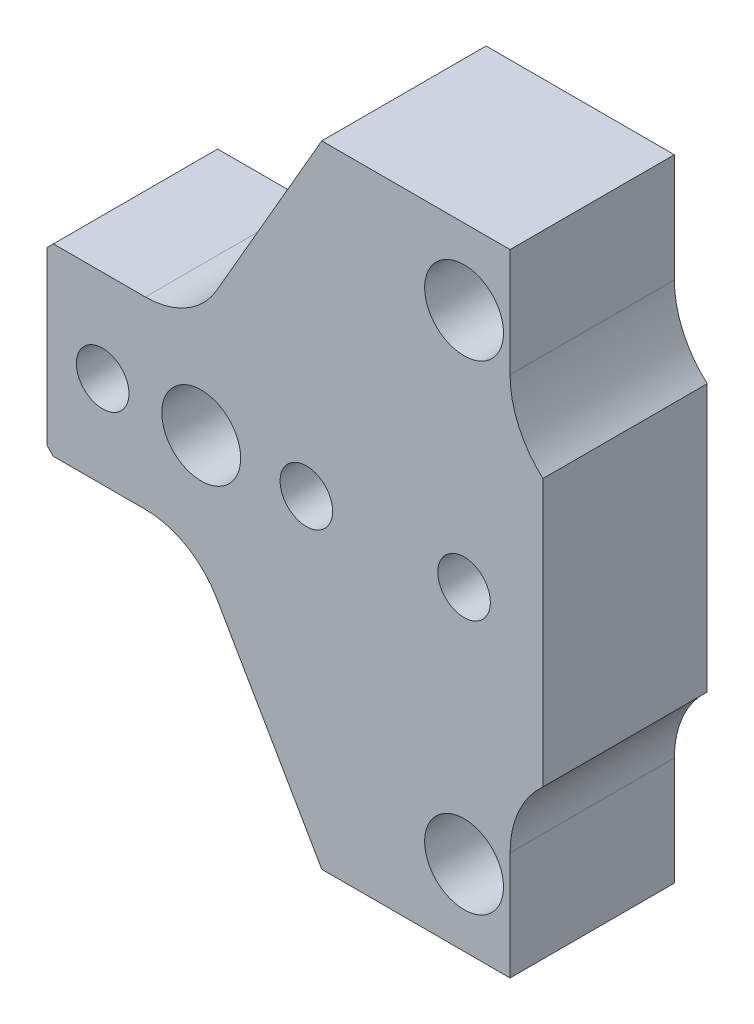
ISO-10303-21;
HEADER;
FILE_DESCRIPTION(('STEP AP214'),'2;1');
FILE_NAME('part.step','',(''),(''),'','','');
FILE_SCHEMA(('AUTOMOTIVE_DESIGN { 1 0 10303 214 1 1 1 1 }'));
ENDSEC;
DATA;
#1=APPLICATION_CONTEXT('core data for automotive mechanical design processes');
#2=APPLICATION_PROTOCOL_DEFINITION('international standard','automotive_design',2000,#1);
#3=PRODUCT_CONTEXT('',#1,'mechanical');
#4=PRODUCT('Part','Part','',(#3));
#5=PRODUCT_RELATED_PRODUCT_CATEGORY('part','',(#4));
#6=PRODUCT_DEFINITION_FORMATION('','',#4);
#7=PRODUCT_DEFINITION_CONTEXT('part definition',#1,'design');
#8=PRODUCT_DEFINITION('design','',#6,#7);
#9=PRODUCT_DEFINITION_SHAPE('','',#8);
#10=(LENGTH_UNIT() NAMED_UNIT(*) SI_UNIT(.MILLI.,.METRE.));
#11=(NAMED_UNIT(*) PLANE_ANGLE_UNIT() SI_UNIT($,.RADIAN.));
#12=(NAMED_UNIT(*) SI_UNIT($,.STERADIAN.) SOLID_ANGLE_UNIT());
#13=UNCERTAINTY_MEASURE_WITH_UNIT(LENGTH_MEASURE(1.E-05),#10,'distance_accuracy_value','');
#14=(GEOMETRIC_REPRESENTATION_CONTEXT(3) GLOBAL_UNCERTAINTY_ASSIGNED_CONTEXT((#13)) GLOBAL_UNIT_ASSIGNED_CONTEXT((#10,
#11,#12)) REPRESENTATION_CONTEXT('',''));
#15=CARTESIAN_POINT('',(0.,0.,0.));
#16=DIRECTION('',(0.,0.,1.));
#17=DIRECTION('',(1.,0.,0.));
#18=AXIS2_PLACEMENT_3D('',#15,#16,#17);
#19=CARTESIAN_POINT('',(-8.5,-26.5,25.));
#20=DIRECTION('',(0.,0.,1.));
#21=DIRECTION('',(1.,0.,0.));
#22=AXIS2_PLACEMENT_3D('',#19,#20,#21);
#23=PLANE('',#22);
#24=CARTESIAN_POINT('',(40.,36.5,25.));
#25=DIRECTION('',(0.,0.,1.));
#26=DIRECTION('',(1.,0.,0.));
#27=AXIS2_PLACEMENT_3D('',#24,#25,#26);
#28=CIRCLE('',#27,6.00000000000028);
#29=CARTESIAN_POINT('',(46.0000000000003,36.5,25.));
#30=VERTEX_POINT('',#29);
#31=EDGE_CURVE('E334',#30,#30,#28,.T.);
#32=ORIENTED_EDGE('',*,*,#31,.F.);
#33=EDGE_LOOP('',(#32));
#34=FACE_BOUND('',#33,.T.);
#35=CARTESIAN_POINT('',(-15.,0.,25.));
#36=DIRECTION('',(0.,0.,1.));
#37=DIRECTION('',(1.,0.,0.));
#38=AXIS2_PLACEMENT_3D('',#35,#36,#37);
#39=CIRCLE('',#38,4.);
#40=CARTESIAN_POINT('',(-11.,0.,25.));
#41=VERTEX_POINT('',#40);
#42=EDGE_CURVE('E346',#41,#41,#39,.T.);
#43=ORIENTED_EDGE('',*,*,#42,.F.);
#44=EDGE_LOOP('',(#43));
#45=FACE_BOUND('',#44,.T.);
#46=CARTESIAN_POINT('',(16.,0.,25.));
#47=DIRECTION('',(0.,0.,1.));
#48=DIRECTION('',(1.,0.,0.));
#49=AXIS2_PLACEMENT_3D('',#46,#47,#48);
#50=CIRCLE('',#49,4.);
#51=CARTESIAN_POINT('',(20.,0.,25.));
#52=VERTEX_POINT('',#51);
#53=EDGE_CURVE('E163',#52,#52,#50,.T.);
#54=ORIENTED_EDGE('',*,*,#53,.F.);
#55=EDGE_LOOP('',(#54));
#56=FACE_BOUND('',#55,.T.);
#57=DIRECTION('',(0.707106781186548,-0.707106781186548,0.));
#58=VECTOR('',#57,1.);
#59=CARTESIAN_POINT('',(-23.5,-13.,25.));
#60=LINE('',#59,#58);
#61=CARTESIAN_POINT('',(-23.5,-13.,25.));
#62=VERTEX_POINT('',#61);
#63=CARTESIAN_POINT('',(-22.5,-14.,25.));
#64=VERTEX_POINT('',#63);
#65=EDGE_CURVE('E190',#62,#64,#60,.T.);
#66=ORIENTED_EDGE('',*,*,#65,.T.);
#67=DIRECTION('',(1.,0.,0.));
#68=VECTOR('',#67,1.);
#69=CARTESIAN_POINT('',(-8.5,-14.,25.));
#70=LINE('',#69,#68);
#71=CARTESIAN_POINT('',(-8.5,-14.,25.));
#72=VERTEX_POINT('',#71);
#73=EDGE_CURVE('E98',#64,#72,#70,.T.);
#74=ORIENTED_EDGE('',*,*,#73,.T.);
#75=CARTESIAN_POINT('',(-8.5,-26.5,25.));
#76=DIRECTION('',(0.,0.,-1.));
#77=DIRECTION('',(1.,0.,0.));
#78=AXIS2_PLACEMENT_3D('',#75,#76,#77);
#79=CIRCLE('',#78,12.5);
#80=CARTESIAN_POINT('',(2.32531754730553,-20.25,25.));
#81=VERTEX_POINT('',#80);
#82=EDGE_CURVE('E229',#72,#81,#79,.T.);
#83=ORIENTED_EDGE('',*,*,#82,.T.);
#84=DIRECTION('',(0.5,-0.866025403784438,0.));
#85=VECTOR('',#84,1.);
#86=CARTESIAN_POINT('',(18.3467875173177,-48.,25.));
#87=LINE('',#86,#85);
#88=CARTESIAN_POINT('',(18.3467875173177,-48.,25.));
#89=VERTEX_POINT('',#88);
#90=EDGE_CURVE('E248',#81,#89,#87,.T.);
#91=ORIENTED_EDGE('',*,*,#90,.T.);
#92=DIRECTION('',(1.,0.,0.));
#93=VECTOR('',#92,1.);
#94=CARTESIAN_POINT('',(47.,-48.,25.));
#95=LINE('',#94,#93);
#96=CARTESIAN_POINT('',(47.,-48.,25.));
#97=VERTEX_POINT('',#96);
#98=EDGE_CURVE('E245',#89,#97,#95,.T.);
#99=ORIENTED_EDGE('',*,*,#98,.T.);
#100=DIRECTION('',(0.,1.,0.));
#101=VECTOR('',#100,1.);
#102=CARTESIAN_POINT('',(47.,-31.5,25.));
#103=LINE('',#102,#101);
#104=CARTESIAN_POINT('',(47.,-31.5,25.));
#105=VERTEX_POINT('',#104);
#106=EDGE_CURVE('E247',#97,#105,#103,.T.);
#107=ORIENTED_EDGE('',*,*,#106,.T.);
#108=CARTESIAN_POINT('',(62.,-31.5,25.));
#109=DIRECTION('',(0.,0.,-1.));
#110=DIRECTION('',(1.,0.,0.));
#111=AXIS2_PLACEMENT_3D('',#108,#109,#110);
#112=CIRCLE('',#111,15.);
#113=CARTESIAN_POINT('',(52.,-20.3196601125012,25.));
#114=VERTEX_POINT('',#113);
#115=EDGE_CURVE('E250',#105,#114,#112,.T.);
#116=ORIENTED_EDGE('',*,*,#115,.T.);
#117=DIRECTION('',(0.,1.,0.));
#118=VECTOR('',#117,1.);
#119=CARTESIAN_POINT('',(52.,20.3196601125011,25.));
#120=LINE('',#119,#118);
#121=CARTESIAN_POINT('',(52.,20.3196601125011,25.));
#122=VERTEX_POINT('',#121);
#123=EDGE_CURVE('E256',#114,#122,#120,.T.);
#124=ORIENTED_EDGE('',*,*,#123,.T.);
#125=CARTESIAN_POINT('',(62.,31.5,25.));
#126=DIRECTION('',(0.,0.,-1.));
#127=DIRECTION('',(1.,0.,0.));
#128=AXIS2_PLACEMENT_3D('',#125,#126,#127);
#129=CIRCLE('',#128,15.);
#130=CARTESIAN_POINT('',(47.,31.5,25.));
#131=VERTEX_POINT('',#130);
#132=EDGE_CURVE('E258',#122,#131,#129,.T.);
#133=ORIENTED_EDGE('',*,*,#132,.T.);
#134=DIRECTION('',(0.,1.,0.));
#135=VECTOR('',#134,1.);
#136=CARTESIAN_POINT('',(47.,48.,25.));
#137=LINE('',#136,#135);
#138=CARTESIAN_POINT('',(47.,48.,25.));
#139=VERTEX_POINT('',#138);
#140=EDGE_CURVE('E260',#131,#139,#137,.T.);
#141=ORIENTED_EDGE('',*,*,#140,.T.);
#142=DIRECTION('',(-1.,0.,0.));
#143=VECTOR('',#142,1.);
#144=CARTESIAN_POINT('',(18.3467875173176,48.,25.));
#145=LINE('',#144,#143);
#146=CARTESIAN_POINT('',(18.3467875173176,48.,25.));
#147=VERTEX_POINT('',#146);
#148=EDGE_CURVE('E262',#139,#147,#145,.T.);
#149=ORIENTED_EDGE('',*,*,#148,.T.);
#150=DIRECTION('',(-0.5,-0.866025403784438,0.));
#151=VECTOR('',#150,1.);
#152=CARTESIAN_POINT('',(2.32531754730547,20.25,25.));
#153=LINE('',#152,#151);
#154=CARTESIAN_POINT('',(2.32531754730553,20.25,25.));
#155=VERTEX_POINT('',#154);
#156=EDGE_CURVE('E264',#147,#155,#153,.T.);
#157=ORIENTED_EDGE('',*,*,#156,.T.);
#158=CARTESIAN_POINT('',(-8.5,26.5,25.));
#159=DIRECTION('',(0.,0.,-1.));
#160=DIRECTION('',(1.,0.,0.));
#161=AXIS2_PLACEMENT_3D('',#158,#159,#160);
#162=CIRCLE('',#161,12.5);
#163=CARTESIAN_POINT('',(-8.5,14.,25.));
#164=VERTEX_POINT('',#163);
#165=EDGE_CURVE('E141',#155,#164,#162,.T.);
#166=ORIENTED_EDGE('',*,*,#165,.T.);
#167=DIRECTION('',(-1.,0.,0.));
#168=VECTOR('',#167,1.);
#169=CARTESIAN_POINT('',(-22.5,14.,25.));
#170=LINE('',#169,#168);
#171=CARTESIAN_POINT('',(-22.5,14.,25.));
#172=VERTEX_POINT('',#171);
#173=EDGE_CURVE('E135',#164,#172,#170,.T.);
#174=ORIENTED_EDGE('',*,*,#173,.T.);
#175=DIRECTION('',(-0.707106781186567,-0.707106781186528,0.));
#176=VECTOR('',#175,1.);
#177=CARTESIAN_POINT('',(-22.5,14.,25.));
#178=LINE('',#177,#176);
#179=CARTESIAN_POINT('',(-23.5,13.,25.));
#180=VERTEX_POINT('',#179);
#181=EDGE_CURVE('E139',#172,#180,#178,.T.);
#182=ORIENTED_EDGE('',*,*,#181,.T.);
#183=DIRECTION('',(0.,-1.,0.));
#184=VECTOR('',#183,1.);
#185=CARTESIAN_POINT('',(-23.5,-13.,25.));
#186=LINE('',#185,#184);
#187=EDGE_CURVE('E31',#180,#62,#186,.T.);
#188=ORIENTED_EDGE('',*,*,#187,.T.);
#189=EDGE_LOOP('',(#66,#74,#83,#91,#99,#107,#116,#124,#133,#141,#149,#157,#166,#174,#182,#188));
#190=FACE_BOUND('',#189,.T.);
#191=CARTESIAN_POINT('',(40.,0.,25.));
#192=DIRECTION('',(0.,0.,1.));
#193=DIRECTION('',(1.,0.,0.));
#194=AXIS2_PLACEMENT_3D('',#191,#192,#193);
#195=CIRCLE('',#194,4.);
#196=CARTESIAN_POINT('',(44.,0.,25.));
#197=VERTEX_POINT('',#196);
#198=EDGE_CURVE('E352',#197,#197,#195,.T.);
#199=ORIENTED_EDGE('',*,*,#198,.F.);
#200=EDGE_LOOP('',(#199));
#201=FACE_BOUND('',#200,.T.);
#202=CARTESIAN_POINT('',(0.,0.,25.));
#203=DIRECTION('',(0.,0.,1.));
#204=DIRECTION('',(1.,0.,0.));
#205=AXIS2_PLACEMENT_3D('',#202,#203,#204);
#206=CIRCLE('',#205,6.00000000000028);
#207=CARTESIAN_POINT('',(6.00000000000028,0.,25.));
#208=VERTEX_POINT('',#207);
#209=EDGE_CURVE('E340',#208,#208,#206,.T.);
#210=ORIENTED_EDGE('',*,*,#209,.F.);
#211=EDGE_LOOP('',(#210));
#212=FACE_BOUND('',#211,.T.);
#213=CARTESIAN_POINT('',(40.,-36.5,25.));
#214=DIRECTION('',(0.,0.,1.));
#215=DIRECTION('',(1.,0.,0.));
#216=AXIS2_PLACEMENT_3D('',#213,#214,#215);
#217=CIRCLE('',#216,6.00000000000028);
#218=CARTESIAN_POINT('',(46.0000000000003,-36.5,25.));
#219=VERTEX_POINT('',#218);
#220=EDGE_CURVE('E325',#219,#219,#217,.T.);
#221=ORIENTED_EDGE('',*,*,#220,.F.);
#222=EDGE_LOOP('',(#221));
#223=FACE_BOUND('',#222,.T.);
#224=ADVANCED_FACE('F14',(#34,#45,#56,#190,#201,#212,#223),#23,.T.);
#225=CARTESIAN_POINT('',(-8.5,-26.5,0.));
#226=DIRECTION('',(0.,0.,1.));
#227=DIRECTION('',(1.,0.,0.));
#228=AXIS2_PLACEMENT_3D('',#225,#226,#227);
#229=PLANE('',#228);
#230=CARTESIAN_POINT('',(40.,36.5,0.));
#231=DIRECTION('',(0.,0.,1.));
#232=DIRECTION('',(1.,0.,0.));
#233=AXIS2_PLACEMENT_3D('',#230,#231,#232);
#234=CIRCLE('',#233,6.00000000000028);
#235=CARTESIAN_POINT('',(46.0000000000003,36.5,0.));
#236=VERTEX_POINT('',#235);
#237=EDGE_CURVE('E331',#236,#236,#234,.T.);
#238=ORIENTED_EDGE('',*,*,#237,.T.);
#239=EDGE_LOOP('',(#238));
#240=FACE_BOUND('',#239,.T.);
#241=CARTESIAN_POINT('',(-15.,0.,0.));
#242=DIRECTION('',(0.,0.,1.));
#243=DIRECTION('',(1.,0.,0.));
#244=AXIS2_PLACEMENT_3D('',#241,#242,#243);
#245=CIRCLE('',#244,4.);
#246=CARTESIAN_POINT('',(-11.,0.,0.));
#247=VERTEX_POINT('',#246);
#248=EDGE_CURVE('E343',#247,#247,#245,.T.);
#249=ORIENTED_EDGE('',*,*,#248,.T.);
#250=EDGE_LOOP('',(#249));
#251=FACE_BOUND('',#250,.T.);
#252=CARTESIAN_POINT('',(16.,0.,0.));
#253=DIRECTION('',(0.,0.,1.));
#254=DIRECTION('',(1.,0.,0.));
#255=AXIS2_PLACEMENT_3D('',#252,#253,#254);
#256=CIRCLE('',#255,4.);
#257=CARTESIAN_POINT('',(20.,0.,0.));
#258=VERTEX_POINT('',#257);
#259=EDGE_CURVE('E355',#258,#258,#256,.T.);
#260=ORIENTED_EDGE('',*,*,#259,.T.);
#261=EDGE_LOOP('',(#260));
#262=FACE_BOUND('',#261,.T.);
#263=DIRECTION('',(0.707106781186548,-0.707106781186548,0.));
#264=VECTOR('',#263,1.);
#265=CARTESIAN_POINT('',(-23.5,-13.,0.));
#266=LINE('',#265,#264);
#267=CARTESIAN_POINT('',(-23.5,-13.,0.));
#268=VERTEX_POINT('',#267);
#269=CARTESIAN_POINT('',(-22.5,-14.,0.));
#270=VERTEX_POINT('',#269);
#271=EDGE_CURVE('E159',#268,#270,#266,.T.);
#272=ORIENTED_EDGE('',*,*,#271,.F.);
#273=DIRECTION('',(0.,-1.,0.));
#274=VECTOR('',#273,1.);
#275=CARTESIAN_POINT('',(-23.5,-13.,0.));
#276=LINE('',#275,#274);
#277=CARTESIAN_POINT('',(-23.5,13.,0.));
#278=VERTEX_POINT('',#277);
#279=EDGE_CURVE('E90',#278,#268,#276,.T.);
#280=ORIENTED_EDGE('',*,*,#279,.F.);
#281=DIRECTION('',(-0.707106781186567,-0.707106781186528,0.));
#282=VECTOR('',#281,1.);
#283=CARTESIAN_POINT('',(-22.5,14.,0.));
#284=LINE('',#283,#282);
#285=CARTESIAN_POINT('',(-22.5,14.,0.));
#286=VERTEX_POINT('',#285);
#287=EDGE_CURVE('E84',#286,#278,#284,.T.);
#288=ORIENTED_EDGE('',*,*,#287,.F.);
#289=DIRECTION('',(-1.,0.,0.));
#290=VECTOR('',#289,1.);
#291=CARTESIAN_POINT('',(-22.5,14.,0.));
#292=LINE('',#291,#290);
#293=CARTESIAN_POINT('',(-8.5,14.,0.));
#294=VERTEX_POINT('',#293);
#295=EDGE_CURVE('E149',#294,#286,#292,.T.);
#296=ORIENTED_EDGE('',*,*,#295,.F.);
#297=CARTESIAN_POINT('',(-8.5,26.5,0.));
#298=DIRECTION('',(0.,0.,-1.));
#299=DIRECTION('',(1.,0.,0.));
#300=AXIS2_PLACEMENT_3D('',#297,#298,#299);
#301=CIRCLE('',#300,12.5);
#302=CARTESIAN_POINT('',(2.32531754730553,20.25,0.));
#303=VERTEX_POINT('',#302);
#304=EDGE_CURVE('E185',#303,#294,#301,.T.);
#305=ORIENTED_EDGE('',*,*,#304,.F.);
#306=DIRECTION('',(-0.5,-0.866025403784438,0.));
#307=VECTOR('',#306,1.);
#308=CARTESIAN_POINT('',(2.32531754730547,20.25,0.));
#309=LINE('',#308,#307);
#310=CARTESIAN_POINT('',(18.3467875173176,48.,0.));
#311=VERTEX_POINT('',#310);
#312=EDGE_CURVE('E183',#311,#303,#309,.T.);
#313=ORIENTED_EDGE('',*,*,#312,.F.);
#314=DIRECTION('',(-1.,0.,0.));
#315=VECTOR('',#314,1.);
#316=CARTESIAN_POINT('',(18.3467875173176,48.,0.));
#317=LINE('',#316,#315);
#318=CARTESIAN_POINT('',(47.,48.,0.));
#319=VERTEX_POINT('',#318);
#320=EDGE_CURVE('E181',#319,#311,#317,.T.);
#321=ORIENTED_EDGE('',*,*,#320,.F.);
#322=DIRECTION('',(0.,1.,0.));
#323=VECTOR('',#322,1.);
#324=CARTESIAN_POINT('',(47.,48.,0.));
#325=LINE('',#324,#323);
#326=CARTESIAN_POINT('',(47.,31.5,0.));
#327=VERTEX_POINT('',#326);
#328=EDGE_CURVE('E179',#327,#319,#325,.T.);
#329=ORIENTED_EDGE('',*,*,#328,.F.);
#330=CARTESIAN_POINT('',(62.,31.5,0.));
#331=DIRECTION('',(0.,0.,-1.));
#332=DIRECTION('',(1.,0.,0.));
#333=AXIS2_PLACEMENT_3D('',#330,#331,#332);
#334=CIRCLE('',#333,15.);
#335=CARTESIAN_POINT('',(52.,20.3196601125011,0.));
#336=VERTEX_POINT('',#335);
#337=EDGE_CURVE('E177',#336,#327,#334,.T.);
#338=ORIENTED_EDGE('',*,*,#337,.F.);
#339=DIRECTION('',(0.,1.,0.));
#340=VECTOR('',#339,1.);
#341=CARTESIAN_POINT('',(52.,20.3196601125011,0.));
#342=LINE('',#341,#340);
#343=CARTESIAN_POINT('',(52.,-20.3196601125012,0.));
#344=VERTEX_POINT('',#343);
#345=EDGE_CURVE('E175',#344,#336,#342,.T.);
#346=ORIENTED_EDGE('',*,*,#345,.F.);
#347=CARTESIAN_POINT('',(62.,-31.5,0.));
#348=DIRECTION('',(0.,0.,-1.));
#349=DIRECTION('',(1.,0.,0.));
#350=AXIS2_PLACEMENT_3D('',#347,#348,#349);
#351=CIRCLE('',#350,15.);
#352=CARTESIAN_POINT('',(47.,-31.5,0.));
#353=VERTEX_POINT('',#352);
#354=EDGE_CURVE('E173',#353,#344,#351,.T.);
#355=ORIENTED_EDGE('',*,*,#354,.F.);
#356=DIRECTION('',(0.,1.,0.));
#357=VECTOR('',#356,1.);
#358=CARTESIAN_POINT('',(47.,-31.5,0.));
#359=LINE('',#358,#357);
#360=CARTESIAN_POINT('',(47.,-48.,0.));
#361=VERTEX_POINT('',#360);
#362=EDGE_CURVE('E171',#361,#353,#359,.T.);
#363=ORIENTED_EDGE('',*,*,#362,.F.);
#364=DIRECTION('',(1.,0.,0.));
#365=VECTOR('',#364,1.);
#366=CARTESIAN_POINT('',(47.,-48.,0.));
#367=LINE('',#366,#365);
#368=CARTESIAN_POINT('',(18.3467875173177,-48.,0.));
#369=VERTEX_POINT('',#368);
#370=EDGE_CURVE('E169',#369,#361,#367,.T.);
#371=ORIENTED_EDGE('',*,*,#370,.F.);
#372=DIRECTION('',(0.5,-0.866025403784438,0.));
#373=VECTOR('',#372,1.);
#374=CARTESIAN_POINT('',(18.3467875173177,-48.,0.));
#375=LINE('',#374,#373);
#376=CARTESIAN_POINT('',(2.32531754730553,-20.25,0.));
#377=VERTEX_POINT('',#376);
#378=EDGE_CURVE('E167',#377,#369,#375,.T.);
#379=ORIENTED_EDGE('',*,*,#378,.F.);
#380=CARTESIAN_POINT('',(-8.5,-26.5,0.));
#381=DIRECTION('',(0.,0.,-1.));
#382=DIRECTION('',(1.,0.,0.));
#383=AXIS2_PLACEMENT_3D('',#380,#381,#382);
#384=CIRCLE('',#383,12.5);
#385=CARTESIAN_POINT('',(-8.5,-14.,0.));
#386=VERTEX_POINT('',#385);
#387=EDGE_CURVE('E165',#386,#377,#384,.T.);
#388=ORIENTED_EDGE('',*,*,#387,.F.);
#389=DIRECTION('',(1.,0.,0.));
#390=VECTOR('',#389,1.);
#391=CARTESIAN_POINT('',(-8.5,-14.,0.));
#392=LINE('',#391,#390);
#393=EDGE_CURVE('E162',#270,#386,#392,.T.);
#394=ORIENTED_EDGE('',*,*,#393,.F.);
#395=EDGE_LOOP('',(#272,#280,#288,#296,#305,#313,#321,#329,#338,#346,#355,#363,#371,#379,#388,#394));
#396=FACE_BOUND('',#395,.T.);
#397=CARTESIAN_POINT('',(40.,0.,0.));
#398=DIRECTION('',(0.,0.,1.));
#399=DIRECTION('',(1.,0.,0.));
#400=AXIS2_PLACEMENT_3D('',#397,#398,#399);
#401=CIRCLE('',#400,4.);
#402=CARTESIAN_POINT('',(44.,0.,0.));
#403=VERTEX_POINT('',#402);
#404=EDGE_CURVE('E349',#403,#403,#401,.T.);
#405=ORIENTED_EDGE('',*,*,#404,.T.);
#406=EDGE_LOOP('',(#405));
#407=FACE_BOUND('',#406,.T.);
#408=CARTESIAN_POINT('',(0.,0.,0.));
#409=DIRECTION('',(0.,0.,1.));
#410=DIRECTION('',(1.,0.,0.));
#411=AXIS2_PLACEMENT_3D('',#408,#409,#410);
#412=CIRCLE('',#411,6.00000000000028);
#413=CARTESIAN_POINT('',(6.00000000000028,0.,0.));
#414=VERTEX_POINT('',#413);
#415=EDGE_CURVE('E337',#414,#414,#412,.T.);
#416=ORIENTED_EDGE('',*,*,#415,.T.);
#417=EDGE_LOOP('',(#416));
#418=FACE_BOUND('',#417,.T.);
#419=CARTESIAN_POINT('',(40.,-36.5,0.));
#420=DIRECTION('',(0.,0.,1.));
#421=DIRECTION('',(1.,0.,0.));
#422=AXIS2_PLACEMENT_3D('',#419,#420,#421);
#423=CIRCLE('',#422,6.00000000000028);
#424=CARTESIAN_POINT('',(46.0000000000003,-36.5,0.));
#425=VERTEX_POINT('',#424);
#426=EDGE_CURVE('E328',#425,#425,#423,.T.);
#427=ORIENTED_EDGE('',*,*,#426,.T.);
#428=EDGE_LOOP('',(#427));
#429=FACE_BOUND('',#428,.T.);
#430=ADVANCED_FACE('F233',(#240,#251,#262,#396,#407,#418,#429),#229,.F.);
#431=CARTESIAN_POINT('',(-23.5,-13.,25.));
#432=DIRECTION('',(0.707106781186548,0.707106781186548,0.));
#433=DIRECTION('',(-0.707106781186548,0.707106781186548,0.));
#434=AXIS2_PLACEMENT_3D('',#431,#432,#433);
#435=PLANE('',#434);
#436=ORIENTED_EDGE('',*,*,#271,.T.);
#437=DIRECTION('',(0.,0.,-1.));
#438=VECTOR('',#437,1.);
#439=CARTESIAN_POINT('',(-22.5,-14.,25.));
#440=LINE('',#439,#438);
#441=EDGE_CURVE('E9',#64,#270,#440,.T.);
#442=ORIENTED_EDGE('',*,*,#441,.F.);
#443=ORIENTED_EDGE('',*,*,#65,.F.);
#444=DIRECTION('',(0.,0.,-1.));
#445=VECTOR('',#444,1.);
#446=CARTESIAN_POINT('',(-23.5,-13.,25.));
#447=LINE('',#446,#445);
#448=EDGE_CURVE('E155',#62,#268,#447,.T.);
#449=ORIENTED_EDGE('',*,*,#448,.T.);
#450=EDGE_LOOP('',(#436,#442,#443,#449));
#451=FACE_BOUND('',#450,.T.);
#452=ADVANCED_FACE('F16',(#451),#435,.F.);
#453=CARTESIAN_POINT('',(-8.5,-14.,25.));
#454=DIRECTION('',(0.,1.,0.));
#455=DIRECTION('',(0.,0.,1.));
#456=AXIS2_PLACEMENT_3D('',#453,#454,#455);
#457=PLANE('',#456);
#458=ORIENTED_EDGE('',*,*,#393,.T.);
#459=DIRECTION('',(0.,0.,-1.));
#460=VECTOR('',#459,1.);
#461=CARTESIAN_POINT('',(-8.5,-14.,25.));
#462=LINE('',#461,#460);
#463=EDGE_CURVE('E23',#72,#386,#462,.T.);
#464=ORIENTED_EDGE('',*,*,#463,.F.);
#465=ORIENTED_EDGE('',*,*,#73,.F.);
#466=ORIENTED_EDGE('',*,*,#441,.T.);
#467=EDGE_LOOP('',(#458,#464,#465,#466));
#468=FACE_BOUND('',#467,.T.);
#469=ADVANCED_FACE('F534',(#468),#457,.F.);
#470=CARTESIAN_POINT('',(-8.5,-26.5,25.));
#471=DIRECTION('',(0.,0.,-1.));
#472=DIRECTION('',(-1.,0.,0.));
#473=AXIS2_PLACEMENT_3D('',#470,#471,#472);
#474=CYLINDRICAL_SURFACE('',#473,12.5);
#475=ORIENTED_EDGE('',*,*,#387,.T.);
#476=DIRECTION('',(0.,0.,-1.));
#477=VECTOR('',#476,1.);
#478=CARTESIAN_POINT('',(2.32531754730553,-20.25,25.));
#479=LINE('',#478,#477);
#480=EDGE_CURVE('E221',#81,#377,#479,.T.);
#481=ORIENTED_EDGE('',*,*,#480,.F.);
#482=ORIENTED_EDGE('',*,*,#82,.F.);
#483=ORIENTED_EDGE('',*,*,#463,.T.);
#484=EDGE_LOOP('',(#475,#481,#482,#483));
#485=FACE_BOUND('',#484,.T.);
#486=ADVANCED_FACE('F227',(#485),#474,.F.);
#487=CARTESIAN_POINT('',(18.3467875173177,-48.,25.));
#488=DIRECTION('',(0.866025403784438,0.5,0.));
#489=DIRECTION('',(-0.5,0.866025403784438,0.));
#490=AXIS2_PLACEMENT_3D('',#487,#488,#489);
#491=PLANE('',#490);
#492=ORIENTED_EDGE('',*,*,#378,.T.);
#493=DIRECTION('',(0.,0.,-1.));
#494=VECTOR('',#493,1.);
#495=CARTESIAN_POINT('',(18.3467875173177,-48.,25.));
#496=LINE('',#495,#494);
#497=EDGE_CURVE('E218',#89,#369,#496,.T.);
#498=ORIENTED_EDGE('',*,*,#497,.F.);
#499=ORIENTED_EDGE('',*,*,#90,.F.);
#500=ORIENTED_EDGE('',*,*,#480,.T.);
#501=EDGE_LOOP('',(#492,#498,#499,#500));
#502=FACE_BOUND('',#501,.T.);
#503=ADVANCED_FACE('F239',(#502),#491,.F.);
#504=CARTESIAN_POINT('',(47.,-48.,25.));
#505=DIRECTION('',(0.,1.,0.));
#506=DIRECTION('',(0.,0.,1.));
#507=AXIS2_PLACEMENT_3D('',#504,#505,#506);
#508=PLANE('',#507);
#509=ORIENTED_EDGE('',*,*,#370,.T.);
#510=DIRECTION('',(0.,0.,-1.));
#511=VECTOR('',#510,1.);
#512=CARTESIAN_POINT('',(47.,-48.,25.));
#513=LINE('',#512,#511);
#514=EDGE_CURVE('E215',#97,#361,#513,.T.);
#515=ORIENTED_EDGE('',*,*,#514,.F.);
#516=ORIENTED_EDGE('',*,*,#98,.F.);
#517=ORIENTED_EDGE('',*,*,#497,.T.);
#518=EDGE_LOOP('',(#509,#515,#516,#517));
#519=FACE_BOUND('',#518,.T.);
#520=ADVANCED_FACE('F243',(#519),#508,.F.);
#521=CARTESIAN_POINT('',(47.,-31.5,25.));
#522=DIRECTION('',(-1.,0.,0.));
#523=DIRECTION('',(0.,0.,1.));
#524=AXIS2_PLACEMENT_3D('',#521,#522,#523);
#525=PLANE('',#524);
#526=ORIENTED_EDGE('',*,*,#362,.T.);
#527=DIRECTION('',(0.,0.,-1.));
#528=VECTOR('',#527,1.);
#529=CARTESIAN_POINT('',(47.,-31.5,25.));
#530=LINE('',#529,#528);
#531=EDGE_CURVE('E212',#105,#353,#530,.T.);
#532=ORIENTED_EDGE('',*,*,#531,.F.);
#533=ORIENTED_EDGE('',*,*,#106,.F.);
#534=ORIENTED_EDGE('',*,*,#514,.T.);
#535=EDGE_LOOP('',(#526,#532,#533,#534));
#536=FACE_BOUND('',#535,.T.);
#537=ADVANCED_FACE('F499',(#536),#525,.F.);
#538=CARTESIAN_POINT('',(62.,-31.5,25.));
#539=DIRECTION('',(0.,0.,-1.));
#540=DIRECTION('',(-1.,0.,0.));
#541=AXIS2_PLACEMENT_3D('',#538,#539,#540);
#542=CYLINDRICAL_SURFACE('',#541,15.);
#543=ORIENTED_EDGE('',*,*,#354,.T.);
#544=DIRECTION('',(0.,0.,-1.));
#545=VECTOR('',#544,1.);
#546=CARTESIAN_POINT('',(52.,-20.3196601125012,25.));
#547=LINE('',#546,#545);
#548=EDGE_CURVE('E209',#114,#344,#547,.T.);
#549=ORIENTED_EDGE('',*,*,#548,.F.);
#550=ORIENTED_EDGE('',*,*,#115,.F.);
#551=ORIENTED_EDGE('',*,*,#531,.T.);
#552=EDGE_LOOP('',(#543,#549,#550,#551));
#553=FACE_BOUND('',#552,.T.);
#554=ADVANCED_FACE('F489',(#553),#542,.F.);
#555=CARTESIAN_POINT('',(52.,20.3196601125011,25.));
#556=DIRECTION('',(-1.,0.,0.));
#557=DIRECTION('',(0.,-1.,0.));
#558=AXIS2_PLACEMENT_3D('',#555,#556,#557);
#559=PLANE('',#558);
#560=ORIENTED_EDGE('',*,*,#345,.T.);
#561=DIRECTION('',(0.,0.,-1.));
#562=VECTOR('',#561,1.);
#563=CARTESIAN_POINT('',(52.,20.3196601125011,25.));
#564=LINE('',#563,#562);
#565=EDGE_CURVE('E206',#122,#336,#564,.T.);
#566=ORIENTED_EDGE('',*,*,#565,.F.);
#567=ORIENTED_EDGE('',*,*,#123,.F.);
#568=ORIENTED_EDGE('',*,*,#548,.T.);
#569=EDGE_LOOP('',(#560,#566,#567,#568));
#570=FACE_BOUND('',#569,.T.);
#571=ADVANCED_FACE('F479',(#570),#559,.F.);
#572=CARTESIAN_POINT('',(62.,31.5,25.));
#573=DIRECTION('',(0.,0.,-1.));
#574=DIRECTION('',(-1.,0.,0.));
#575=AXIS2_PLACEMENT_3D('',#572,#573,#574);
#576=CYLINDRICAL_SURFACE('',#575,15.);
#577=ORIENTED_EDGE('',*,*,#337,.T.);
#578=DIRECTION('',(0.,0.,-1.));
#579=VECTOR('',#578,1.);
#580=CARTESIAN_POINT('',(47.,31.5,25.));
#581=LINE('',#580,#579);
#582=EDGE_CURVE('E203',#131,#327,#581,.T.);
#583=ORIENTED_EDGE('',*,*,#582,.F.);
#584=ORIENTED_EDGE('',*,*,#132,.F.);
#585=ORIENTED_EDGE('',*,*,#565,.T.);
#586=EDGE_LOOP('',(#577,#583,#584,#585));
#587=FACE_BOUND('',#586,.T.);
#588=ADVANCED_FACE('F469',(#587),#576,.F.);
#589=CARTESIAN_POINT('',(47.,48.,25.));
#590=DIRECTION('',(-1.,0.,0.));
#591=DIRECTION('',(0.,0.,1.));
#592=AXIS2_PLACEMENT_3D('',#589,#590,#591);
#593=PLANE('',#592);
#594=ORIENTED_EDGE('',*,*,#328,.T.);
#595=DIRECTION('',(0.,0.,-1.));
#596=VECTOR('',#595,1.);
#597=CARTESIAN_POINT('',(47.,48.,25.));
#598=LINE('',#597,#596);
#599=EDGE_CURVE('E200',#139,#319,#598,.T.);
#600=ORIENTED_EDGE('',*,*,#599,.F.);
#601=ORIENTED_EDGE('',*,*,#140,.F.);
#602=ORIENTED_EDGE('',*,*,#582,.T.);
#603=EDGE_LOOP('',(#594,#600,#601,#602));
#604=FACE_BOUND('',#603,.T.);
#605=ADVANCED_FACE('F459',(#604),#593,.F.);
#606=CARTESIAN_POINT('',(18.3467875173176,48.,25.));
#607=DIRECTION('',(0.,-1.,0.));
#608=DIRECTION('',(0.,0.,-1.));
#609=AXIS2_PLACEMENT_3D('',#606,#607,#608);
#610=PLANE('',#609);
#611=ORIENTED_EDGE('',*,*,#320,.T.);
#612=DIRECTION('',(0.,0.,-1.));
#613=VECTOR('',#612,1.);
#614=CARTESIAN_POINT('',(18.3467875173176,48.,25.));
#615=LINE('',#614,#613);
#616=EDGE_CURVE('E197',#147,#311,#615,.T.);
#617=ORIENTED_EDGE('',*,*,#616,.F.);
#618=ORIENTED_EDGE('',*,*,#148,.F.);
#619=ORIENTED_EDGE('',*,*,#599,.T.);
#620=EDGE_LOOP('',(#611,#617,#618,#619));
#621=FACE_BOUND('',#620,.T.);
#622=ADVANCED_FACE('F450',(#621),#610,.F.);
#623=CARTESIAN_POINT('',(2.32531754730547,20.25,25.));
#624=DIRECTION('',(0.866025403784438,-0.5,0.));
#625=DIRECTION('',(0.5,0.866025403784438,0.));
#626=AXIS2_PLACEMENT_3D('',#623,#624,#625);
#627=PLANE('',#626);
#628=ORIENTED_EDGE('',*,*,#312,.T.);
#629=DIRECTION('',(0.,0.,-1.));
#630=VECTOR('',#629,1.);
#631=CARTESIAN_POINT('',(2.32531754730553,20.25,25.));
#632=LINE('',#631,#630);
#633=EDGE_CURVE('E194',#155,#303,#632,.T.);
#634=ORIENTED_EDGE('',*,*,#633,.F.);
#635=ORIENTED_EDGE('',*,*,#156,.F.);
#636=ORIENTED_EDGE('',*,*,#616,.T.);
#637=EDGE_LOOP('',(#628,#634,#635,#636));
#638=FACE_BOUND('',#637,.T.);
#639=ADVANCED_FACE('F270',(#638),#627,.F.);
#640=CARTESIAN_POINT('',(-8.5,26.5,25.));
#641=DIRECTION('',(0.,0.,-1.));
#642=DIRECTION('',(-1.,0.,0.));
#643=AXIS2_PLACEMENT_3D('',#640,#641,#642);
#644=CYLINDRICAL_SURFACE('',#643,12.5);
#645=ORIENTED_EDGE('',*,*,#304,.T.);
#646=DIRECTION('',(0.,0.,-1.));
#647=VECTOR('',#646,1.);
#648=CARTESIAN_POINT('',(-8.5,14.,25.));
#649=LINE('',#648,#647);
#650=EDGE_CURVE('E150',#164,#294,#649,.T.);
#651=ORIENTED_EDGE('',*,*,#650,.F.);
#652=ORIENTED_EDGE('',*,*,#165,.F.);
#653=ORIENTED_EDGE('',*,*,#633,.T.);
#654=EDGE_LOOP('',(#645,#651,#652,#653));
#655=FACE_BOUND('',#654,.T.);
#656=ADVANCED_FACE('F274',(#655),#644,.F.);
#657=CARTESIAN_POINT('',(-22.5,14.,25.));
#658=DIRECTION('',(0.,-1.,0.));
#659=DIRECTION('',(1.,0.,0.));
#660=AXIS2_PLACEMENT_3D('',#657,#658,#659);
#661=PLANE('',#660);
#662=ORIENTED_EDGE('',*,*,#295,.T.);
#663=DIRECTION('',(0.,0.,-1.));
#664=VECTOR('',#663,1.);
#665=CARTESIAN_POINT('',(-22.5,14.,25.));
#666=LINE('',#665,#664);
#667=EDGE_CURVE('E146',#172,#286,#666,.T.);
#668=ORIENTED_EDGE('',*,*,#667,.F.);
#669=ORIENTED_EDGE('',*,*,#173,.F.);
#670=ORIENTED_EDGE('',*,*,#650,.T.);
#671=EDGE_LOOP('',(#662,#668,#669,#670));
#672=FACE_BOUND('',#671,.T.);
#673=ADVANCED_FACE('F147',(#672),#661,.F.);
#674=CARTESIAN_POINT('',(-22.5,14.,25.));
#675=DIRECTION('',(0.707106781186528,-0.707106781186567,0.));
#676=DIRECTION('',(0.707106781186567,0.707106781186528,0.));
#677=AXIS2_PLACEMENT_3D('',#674,#675,#676);
#678=PLANE('',#677);
#679=ORIENTED_EDGE('',*,*,#287,.T.);
#680=DIRECTION('',(0.,0.,-1.));
#681=VECTOR('',#680,1.);
#682=CARTESIAN_POINT('',(-23.5,13.,25.));
#683=LINE('',#682,#681);
#684=EDGE_CURVE('E151',#180,#278,#683,.T.);
#685=ORIENTED_EDGE('',*,*,#684,.F.);
#686=ORIENTED_EDGE('',*,*,#181,.F.);
#687=ORIENTED_EDGE('',*,*,#667,.T.);
#688=EDGE_LOOP('',(#679,#685,#686,#687));
#689=FACE_BOUND('',#688,.T.);
#690=ADVANCED_FACE('F153',(#689),#678,.F.);
#691=CARTESIAN_POINT('',(-23.5,-13.,25.));
#692=DIRECTION('',(1.,0.,0.));
#693=DIRECTION('',(0.,0.,-1.));
#694=AXIS2_PLACEMENT_3D('',#691,#692,#693);
#695=PLANE('',#694);
#696=ORIENTED_EDGE('',*,*,#279,.T.);
#697=ORIENTED_EDGE('',*,*,#448,.F.);
#698=ORIENTED_EDGE('',*,*,#187,.F.);
#699=ORIENTED_EDGE('',*,*,#684,.T.);
#700=EDGE_LOOP('',(#696,#697,#698,#699));
#701=FACE_BOUND('',#700,.T.);
#702=ADVANCED_FACE('F278',(#701),#695,.F.);
#703=CARTESIAN_POINT('',(16.,0.,25.));
#704=DIRECTION('',(0.,0.,-1.));
#705=DIRECTION('',(-1.,0.,0.));
#706=AXIS2_PLACEMENT_3D('',#703,#704,#705);
#707=CYLINDRICAL_SURFACE('',#706,4.);
#708=ORIENTED_EDGE('',*,*,#53,.T.);
#709=EDGE_LOOP('',(#708));
#710=FACE_BOUND('',#709,.T.);
#711=ORIENTED_EDGE('',*,*,#259,.F.);
#712=EDGE_LOOP('',(#711));
#713=FACE_BOUND('',#712,.T.);
#714=ADVANCED_FACE('F280',(#710,#713),#707,.F.);
#715=CARTESIAN_POINT('',(40.,0.,25.));
#716=DIRECTION('',(0.,0.,-1.));
#717=DIRECTION('',(-1.,0.,0.));
#718=AXIS2_PLACEMENT_3D('',#715,#716,#717);
#719=CYLINDRICAL_SURFACE('',#718,4.);
#720=ORIENTED_EDGE('',*,*,#198,.T.);
#721=EDGE_LOOP('',(#720));
#722=FACE_BOUND('',#721,.T.);
#723=ORIENTED_EDGE('',*,*,#404,.F.);
#724=EDGE_LOOP('',(#723));
#725=FACE_BOUND('',#724,.T.);
#726=ADVANCED_FACE('F287',(#722,#725),#719,.F.);
#727=CARTESIAN_POINT('',(-15.,0.,25.));
#728=DIRECTION('',(0.,0.,-1.));
#729=DIRECTION('',(-1.,0.,0.));
#730=AXIS2_PLACEMENT_3D('',#727,#728,#729);
#731=CYLINDRICAL_SURFACE('',#730,4.);
#732=ORIENTED_EDGE('',*,*,#42,.T.);
#733=EDGE_LOOP('',(#732));
#734=FACE_BOUND('',#733,.T.);
#735=ORIENTED_EDGE('',*,*,#248,.F.);
#736=EDGE_LOOP('',(#735));
#737=FACE_BOUND('',#736,.T.);
#738=ADVANCED_FACE('F304',(#734,#737),#731,.F.);
#739=CARTESIAN_POINT('',(0.,0.,25.));
#740=DIRECTION('',(0.,0.,-1.));
#741=DIRECTION('',(-1.,0.,0.));
#742=AXIS2_PLACEMENT_3D('',#739,#740,#741);
#743=CYLINDRICAL_SURFACE('',#742,6.00000000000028);
#744=ORIENTED_EDGE('',*,*,#209,.T.);
#745=EDGE_LOOP('',(#744));
#746=FACE_BOUND('',#745,.T.);
#747=ORIENTED_EDGE('',*,*,#415,.F.);
#748=EDGE_LOOP('',(#747));
#749=FACE_BOUND('',#748,.T.);
#750=ADVANCED_FACE('F308',(#746,#749),#743,.F.);
#751=CARTESIAN_POINT('',(40.,36.5,25.));
#752=DIRECTION('',(0.,0.,-1.));
#753=DIRECTION('',(-1.,0.,0.));
#754=AXIS2_PLACEMENT_3D('',#751,#752,#753);
#755=CYLINDRICAL_SURFACE('',#754,6.00000000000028);
#756=ORIENTED_EDGE('',*,*,#31,.T.);
#757=EDGE_LOOP('',(#756));
#758=FACE_BOUND('',#757,.T.);
#759=ORIENTED_EDGE('',*,*,#237,.F.);
#760=EDGE_LOOP('',(#759));
#761=FACE_BOUND('',#760,.T.);
#762=ADVANCED_FACE('F312',(#758,#761),#755,.F.);
#763=CARTESIAN_POINT('',(40.,-36.5,25.));
#764=DIRECTION('',(0.,0.,-1.));
#765=DIRECTION('',(-1.,0.,0.));
#766=AXIS2_PLACEMENT_3D('',#763,#764,#765);
#767=CYLINDRICAL_SURFACE('',#766,6.00000000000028);
#768=ORIENTED_EDGE('',*,*,#220,.T.);
#769=EDGE_LOOP('',(#768));
#770=FACE_BOUND('',#769,.T.);
#771=ORIENTED_EDGE('',*,*,#426,.F.);
#772=EDGE_LOOP('',(#771));
#773=FACE_BOUND('',#772,.T.);
#774=ADVANCED_FACE('F316',(#770,#773),#767,.F.);
#775=CLOSED_SHELL('',(#224,#430,#452,#469,#486,#503,#520,#537,#554,#571,#588,#605,#622,#639,
#656,#673,#690,#702,#714,#726,#738,#750,#762,#774));
#776=MANIFOLD_SOLID_BREP('B1',#775);
#777=ADVANCED_BREP_SHAPE_REPRESENTATION('',(#18,#776),#14);
#778=SHAPE_DEFINITION_REPRESENTATION(#9,#777);
ENDSEC;
END-ISO-10303-21;
